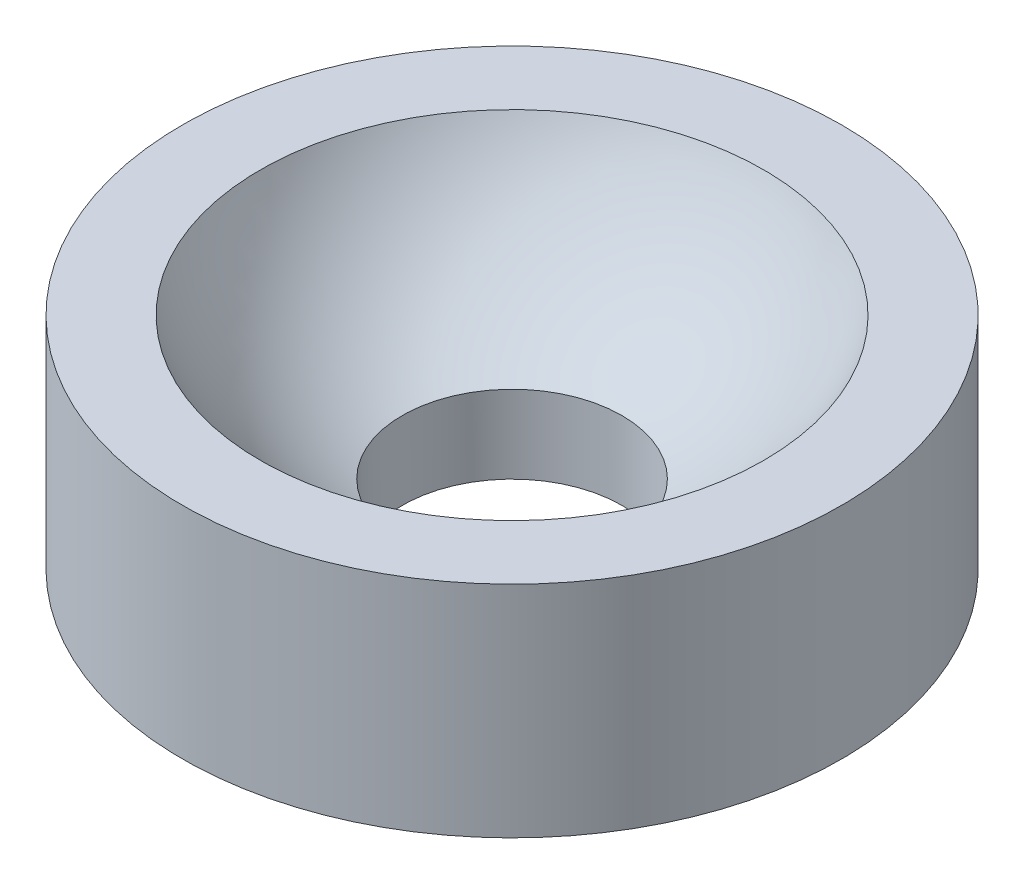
ISO-10303-21;
HEADER;
FILE_DESCRIPTION(('STEP AP214'),'2;1');
FILE_NAME('part.step','',(''),(''),'','','');
FILE_SCHEMA(('AUTOMOTIVE_DESIGN { 1 0 10303 214 1 1 1 1 }'));
ENDSEC;
DATA;
#1=APPLICATION_CONTEXT('core data for automotive mechanical design processes');
#2=APPLICATION_PROTOCOL_DEFINITION('international standard','automotive_design',2000,#1);
#3=PRODUCT_CONTEXT('',#1,'mechanical');
#4=PRODUCT('Part','Part','',(#3));
#5=PRODUCT_RELATED_PRODUCT_CATEGORY('part','',(#4));
#6=PRODUCT_DEFINITION_FORMATION('','',#4);
#7=PRODUCT_DEFINITION_CONTEXT('part definition',#1,'design');
#8=PRODUCT_DEFINITION('design','',#6,#7);
#9=PRODUCT_DEFINITION_SHAPE('','',#8);
#10=(LENGTH_UNIT() NAMED_UNIT(*) SI_UNIT(.MILLI.,.METRE.));
#11=(NAMED_UNIT(*) PLANE_ANGLE_UNIT() SI_UNIT($,.RADIAN.));
#12=(NAMED_UNIT(*) SI_UNIT($,.STERADIAN.) SOLID_ANGLE_UNIT());
#13=UNCERTAINTY_MEASURE_WITH_UNIT(LENGTH_MEASURE(1.E-05),#10,'distance_accuracy_value','');
#14=(GEOMETRIC_REPRESENTATION_CONTEXT(3) GLOBAL_UNCERTAINTY_ASSIGNED_CONTEXT((#13)) GLOBAL_UNIT_ASSIGNED_CONTEXT((#10,
#11,#12)) REPRESENTATION_CONTEXT('',''));
#15=CARTESIAN_POINT('',(0.,0.,0.));
#16=DIRECTION('',(0.,0.,1.));
#17=DIRECTION('',(1.,0.,0.));
#18=AXIS2_PLACEMENT_3D('',#15,#16,#17);
#19=CARTESIAN_POINT('',(0.,6.,0.));
#20=DIRECTION('',(0.,-1.,0.));
#21=DIRECTION('',(1.,0.,0.));
#22=AXIS2_PLACEMENT_3D('',#19,#20,#21);
#23=SPHERICAL_SURFACE('',#22,5.);
#24=CARTESIAN_POINT('',(0.,1.41742430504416,0.));
#25=DIRECTION('',(0.,1.,0.));
#26=DIRECTION('',(0.,0.,1.));
#27=AXIS2_PLACEMENT_3D('',#24,#25,#26);
#28=CIRCLE('',#27,2.);
#29=CARTESIAN_POINT('',(2.,1.41742430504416,0.));
#30=VERTEX_POINT('',#29);
#31=EDGE_CURVE('E46',#30,#30,#28,.T.);
#32=CARTESIAN_POINT('',(0.,4.,0.));
#33=DIRECTION('',(0.,-1.,0.));
#34=DIRECTION('',(0.,0.,-1.));
#35=AXIS2_PLACEMENT_3D('',#32,#33,#34);
#36=CIRCLE('',#35,4.58257569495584);
#37=CARTESIAN_POINT('',(4.58257569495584,4.,0.));
#38=VERTEX_POINT('',#37);
#39=EDGE_CURVE('E10',#38,#38,#36,.T.);
#40=CARTESIAN_POINT('',(2.,1.41742430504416,0.));
#41=CARTESIAN_POINT('',(2.0356946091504,1.43300261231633,0.));
#42=CARTESIAN_POINT('',(2.07120713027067,1.44899812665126,0.));
#43=CARTESIAN_POINT('',(2.14184877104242,1.48181448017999,0.));
#44=CARTESIAN_POINT('',(2.17697789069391,1.49863531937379,0.));
#45=CARTESIAN_POINT('',(2.24683350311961,1.53309323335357,0.));
#46=CARTESIAN_POINT('',(2.28155999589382,1.55073030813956,0.));
#47=CARTESIAN_POINT('',(2.3505914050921,1.58681103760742,0.));
#48=CARTESIAN_POINT('',(2.38489632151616,1.60525469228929,0.));
#49=CARTESIAN_POINT('',(2.45306584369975,1.64293851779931,0.));
#50=CARTESIAN_POINT('',(2.48693044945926,1.66217868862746,0.));
#51=CARTESIAN_POINT('',(2.55420086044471,1.70144503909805,0.));
#52=CARTESIAN_POINT('',(2.58760666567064,1.72147121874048,0.));
#53=CARTESIAN_POINT('',(2.65394123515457,1.7622986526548,0.));
#54=CARTESIAN_POINT('',(2.68686999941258,1.78309990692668,0.));
#55=CARTESIAN_POINT('',(2.75223250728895,1.82546613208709,0.));
#56=CARTESIAN_POINT('',(2.78466625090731,1.84703110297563,0.));
#57=CARTESIAN_POINT('',(2.84902100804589,1.89091298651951,0.));
#58=CARTESIAN_POINT('',(2.88094202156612,1.91322989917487,0.));
#59=CARTESIAN_POINT('',(2.94425388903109,1.95860348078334,0.));
#60=CARTESIAN_POINT('',(2.97564474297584,1.98166014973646,0.));
#61=CARTESIAN_POINT('',(3.0378791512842,2.02850065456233,0.));
#62=CARTESIAN_POINT('',(3.06872270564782,2.05228449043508,0.));
#63=CARTESIAN_POINT('',(3.12984567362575,2.1005663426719,0.));
#64=CARTESIAN_POINT('',(3.16012508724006,2.12506435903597,0.));
#65=CARTESIAN_POINT('',(3.22010324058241,2.17476119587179,0.));
#66=CARTESIAN_POINT('',(3.24980198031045,2.19996001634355,0.));
#67=CARTESIAN_POINT('',(3.3086025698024,2.25104470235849,0.));
#68=CARTESIAN_POINT('',(3.33770441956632,2.27693056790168,0.));
#69=CARTESIAN_POINT('',(3.39529533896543,2.32937520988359,0.));
#70=CARTESIAN_POINT('',(3.42378440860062,2.35593398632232,0.));
#71=CARTESIAN_POINT('',(3.48013421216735,2.40970994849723,0.));
#72=CARTESIAN_POINT('',(3.50799494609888,2.43692713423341,0.));
#73=CARTESIAN_POINT('',(3.56307286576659,2.49200505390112,0.));
#74=CARTESIAN_POINT('',(3.59029005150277,2.51986578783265,0.));
#75=CARTESIAN_POINT('',(3.64406601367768,2.57621559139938,0.));
#76=CARTESIAN_POINT('',(3.67062479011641,2.60470466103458,0.));
#77=CARTESIAN_POINT('',(3.72306943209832,2.66229558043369,0.));
#78=CARTESIAN_POINT('',(3.74895529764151,2.6913974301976,0.));
#79=CARTESIAN_POINT('',(3.80003998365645,2.75019801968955,0.));
#80=CARTESIAN_POINT('',(3.82523880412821,2.77989675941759,0.));
#81=CARTESIAN_POINT('',(3.87493564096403,2.83987491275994,0.));
#82=CARTESIAN_POINT('',(3.8994336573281,2.87015432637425,0.));
#83=CARTESIAN_POINT('',(3.94771550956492,2.93127729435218,0.));
#84=CARTESIAN_POINT('',(3.97149934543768,2.9621208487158,0.));
#85=CARTESIAN_POINT('',(4.01833985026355,3.02435525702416,0.));
#86=CARTESIAN_POINT('',(4.04139651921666,3.05574611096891,0.));
#87=CARTESIAN_POINT('',(4.08677010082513,3.11905797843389,0.));
#88=CARTESIAN_POINT('',(4.10908701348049,3.15097899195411,0.));
#89=CARTESIAN_POINT('',(4.15296889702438,3.21533374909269,0.));
#90=CARTESIAN_POINT('',(4.17453386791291,3.24776749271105,0.));
#91=CARTESIAN_POINT('',(4.21690009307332,3.31313000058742,0.));
#92=CARTESIAN_POINT('',(4.2377013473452,3.34605876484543,0.));
#93=CARTESIAN_POINT('',(4.27852878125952,3.41239333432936,0.));
#94=CARTESIAN_POINT('',(4.29855496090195,3.44579913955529,0.));
#95=CARTESIAN_POINT('',(4.33782131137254,3.51306955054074,0.));
#96=CARTESIAN_POINT('',(4.35706148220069,3.54693415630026,0.));
#97=CARTESIAN_POINT('',(4.39474530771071,3.61510367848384,0.));
#98=CARTESIAN_POINT('',(4.41318896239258,3.64940859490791,0.));
#99=CARTESIAN_POINT('',(4.44926969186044,3.71844000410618,0.));
#100=CARTESIAN_POINT('',(4.46690676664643,3.75316649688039,0.));
#101=CARTESIAN_POINT('',(4.50136468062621,3.82302210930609,0.));
#102=CARTESIAN_POINT('',(4.51818551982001,3.85815122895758,0.));
#103=CARTESIAN_POINT('',(4.55100187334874,3.92879286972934,0.));
#104=CARTESIAN_POINT('',(4.56699738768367,3.9643053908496,0.));
#105=CARTESIAN_POINT('',(4.58257569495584,4.,0.));
#106=B_SPLINE_CURVE_WITH_KNOTS('',3,(#40,#41,#42,#43,#44,#45,#46,#47,#48,#49,#50,#51,#52,#53,
#54,#55,#56,#57,#58,#59,#60,#61,#62,#63,#64,#65,#66,#67,#68,#69,#70,#71,#72,#73,#74,#75,#76,#77,
#78,#79,#80,#81,#82,#83,#84,#85,#86,#87,#88,#89,#90,#91,#92,#93,#94,#95,#96,#97,#98,#99,#100,
#101,#102,#103,#104,#105),.UNSPECIFIED.,.F.,.F.,(4,2,2,2,2,2,2,2,2,2,2,2,2,2,2,2,2,2,2,2,2,2,2,
2,2,2,2,2,2,2,2,2,4),(0.,0.11683525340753,0.233670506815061,0.350505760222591,0.467341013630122,
0.584176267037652,0.701011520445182,0.817846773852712,0.934682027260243,1.05151728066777,
1.1683525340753,1.28518778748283,1.40202304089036,1.51885829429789,1.63569354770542,
1.75252880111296,1.86936405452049,1.98619930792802,2.10303456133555,2.21986981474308,
2.33670506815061,2.45354032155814,2.57037557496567,2.6872108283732,2.80404608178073,
2.92088133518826,3.03771658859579,3.15455184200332,3.27138709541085,3.38822234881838,
3.50505760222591,3.62189285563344,3.73872810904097),.UNSPECIFIED.);
#107=EDGE_CURVE('BSEAM32',#30,#38,#106,.T.);
#108=ORIENTED_EDGE('',*,*,#31,.F.);
#109=ORIENTED_EDGE('',*,*,#39,.F.);
#110=ORIENTED_EDGE('',*,*,#107,.T.);
#111=ORIENTED_EDGE('',*,*,#107,.F.);
#112=EDGE_LOOP('',(#108,#110,#109,#111));
#113=FACE_BOUND('',#112,.T.);
#114=ADVANCED_FACE('F32',(#113),#23,.F.);
#115=CARTESIAN_POINT('',(6.,4.,0.));
#116=DIRECTION('',(0.,1.,0.));
#117=DIRECTION('',(0.,0.,1.));
#118=AXIS2_PLACEMENT_3D('',#115,#116,#117);
#119=PLANE('',#118);
#120=ORIENTED_EDGE('',*,*,#39,.T.);
#121=EDGE_LOOP('',(#120));
#122=FACE_BOUND('',#121,.T.);
#123=CARTESIAN_POINT('',(0.,4.,0.));
#124=DIRECTION('',(0.,-1.,0.));
#125=DIRECTION('',(0.,0.,-1.));
#126=AXIS2_PLACEMENT_3D('',#123,#124,#125);
#127=CIRCLE('',#126,6.);
#128=CARTESIAN_POINT('',(0.,4.,-6.));
#129=VERTEX_POINT('',#128);
#130=EDGE_CURVE('E38',#129,#129,#127,.T.);
#131=ORIENTED_EDGE('',*,*,#130,.F.);
#132=EDGE_LOOP('',(#131));
#133=FACE_BOUND('',#132,.T.);
#134=ADVANCED_FACE('F65',(#122,#133),#119,.T.);
#135=CARTESIAN_POINT('',(0.,0.,0.));
#136=DIRECTION('',(0.,-1.,0.));
#137=DIRECTION('',(0.,0.,-1.));
#138=AXIS2_PLACEMENT_3D('',#135,#136,#137);
#139=CYLINDRICAL_SURFACE('',#138,6.);
#140=ORIENTED_EDGE('',*,*,#130,.T.);
#141=EDGE_LOOP('',(#140));
#142=FACE_BOUND('',#141,.T.);
#143=CARTESIAN_POINT('',(0.,0.,0.));
#144=DIRECTION('',(0.,-1.,0.));
#145=DIRECTION('',(0.,0.,-1.));
#146=AXIS2_PLACEMENT_3D('',#143,#144,#145);
#147=CIRCLE('',#146,6.);
#148=CARTESIAN_POINT('',(0.,0.,-6.));
#149=VERTEX_POINT('',#148);
#150=EDGE_CURVE('E42',#149,#149,#147,.T.);
#151=ORIENTED_EDGE('',*,*,#150,.F.);
#152=EDGE_LOOP('',(#151));
#153=FACE_BOUND('',#152,.T.);
#154=ADVANCED_FACE('F60',(#142,#153),#139,.T.);
#155=CARTESIAN_POINT('',(0.,0.,0.));
#156=DIRECTION('',(0.,-1.,0.));
#157=DIRECTION('',(0.,0.,-1.));
#158=AXIS2_PLACEMENT_3D('',#155,#156,#157);
#159=PLANE('',#158);
#160=CARTESIAN_POINT('',(0.,0.,0.));
#161=DIRECTION('',(0.,-1.,0.));
#162=DIRECTION('',(0.,0.,-1.));
#163=AXIS2_PLACEMENT_3D('',#160,#161,#162);
#164=CIRCLE('',#163,2.);
#165=CARTESIAN_POINT('',(0.,0.,-2.));
#166=VERTEX_POINT('',#165);
#167=EDGE_CURVE('E51',#166,#166,#164,.T.);
#168=ORIENTED_EDGE('',*,*,#167,.F.);
#169=EDGE_LOOP('',(#168));
#170=FACE_BOUND('',#169,.T.);
#171=ORIENTED_EDGE('',*,*,#150,.T.);
#172=EDGE_LOOP('',(#171));
#173=FACE_BOUND('',#172,.T.);
#174=ADVANCED_FACE('F57',(#170,#173),#159,.T.);
#175=CARTESIAN_POINT('',(0.,10.,0.));
#176=DIRECTION('',(0.,-1.,0.));
#177=DIRECTION('',(0.,0.,-1.));
#178=AXIS2_PLACEMENT_3D('',#175,#176,#177);
#179=CYLINDRICAL_SURFACE('',#178,2.);
#180=ORIENTED_EDGE('',*,*,#31,.T.);
#181=EDGE_LOOP('',(#180));
#182=FACE_BOUND('',#181,.T.);
#183=ORIENTED_EDGE('',*,*,#167,.T.);
#184=EDGE_LOOP('',(#183));
#185=FACE_BOUND('',#184,.T.);
#186=ADVANCED_FACE('F55',(#182,#185),#179,.F.);
#187=CLOSED_SHELL('',(#114,#134,#154,#174,#186));
#188=MANIFOLD_SOLID_BREP('B2',#187);
#189=ADVANCED_BREP_SHAPE_REPRESENTATION('',(#18,#188),#14);
#190=SHAPE_DEFINITION_REPRESENTATION(#9,#189);
ENDSEC;
END-ISO-10303-21;
